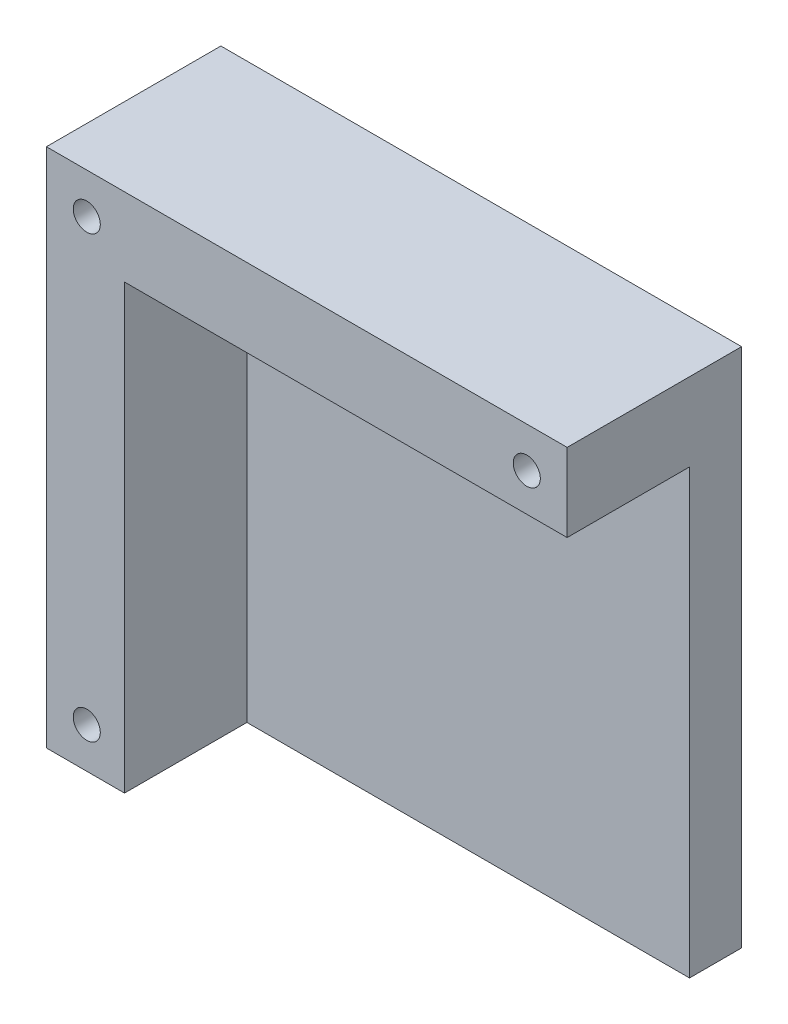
from build123d import *

# Parameters (mm, degrees)
ESQUISSE1_W             = 100
ESQUISSE1_H             = 100
BOSS_EXTRU_1_DEPTH      = 33.5
ESQUISSE2_W             = 85
ESQUISSE2_H             = 85
ENL_V_MAT_EXTRU_1_DEPTH = 23.5
ESQUISSE3_R             = 2.6
ENL_V_MAT_EXTRU_4_DEPTH = 40


with BuildPart() as part:
    # Esquisse1 → Boss.-Extru.1 (new body)
    with BuildSketch(Plane.XY):
        with Locations((-9.989339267, -20.147485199)):
            Rectangle(ESQUISSE1_W, ESQUISSE1_H)
    extrude(amount=BOSS_EXTRU_1_DEPTH)

    # Esquisse2 → Enl_v. mat.-Extru.1 (cut)
    with BuildSketch(Plane.XY.offset(33.5)):
        with Locations((-2.489339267, -27.647485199)):
            Rectangle(ESQUISSE2_W, ESQUISSE2_H)
    extrude(amount=-ENL_V_MAT_EXTRU_1_DEPTH, mode=Mode.SUBTRACT)

    # Esquisse3 → Enl_v. mat.-Extru.4 (cut)
    with BuildSketch(Plane.XY):
        with Locations((32.260660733, 22.102514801)):
            Circle(ESQUISSE3_R)
        with Locations((-52.239339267, -62.397485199)):
            Circle(ESQUISSE3_R)
        with Locations((-52.239339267, 22.102514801)):
            Circle(ESQUISSE3_R)
    extrude(amount=ENL_V_MAT_EXTRU_4_DEPTH, mode=Mode.SUBTRACT)


solid = part.part
